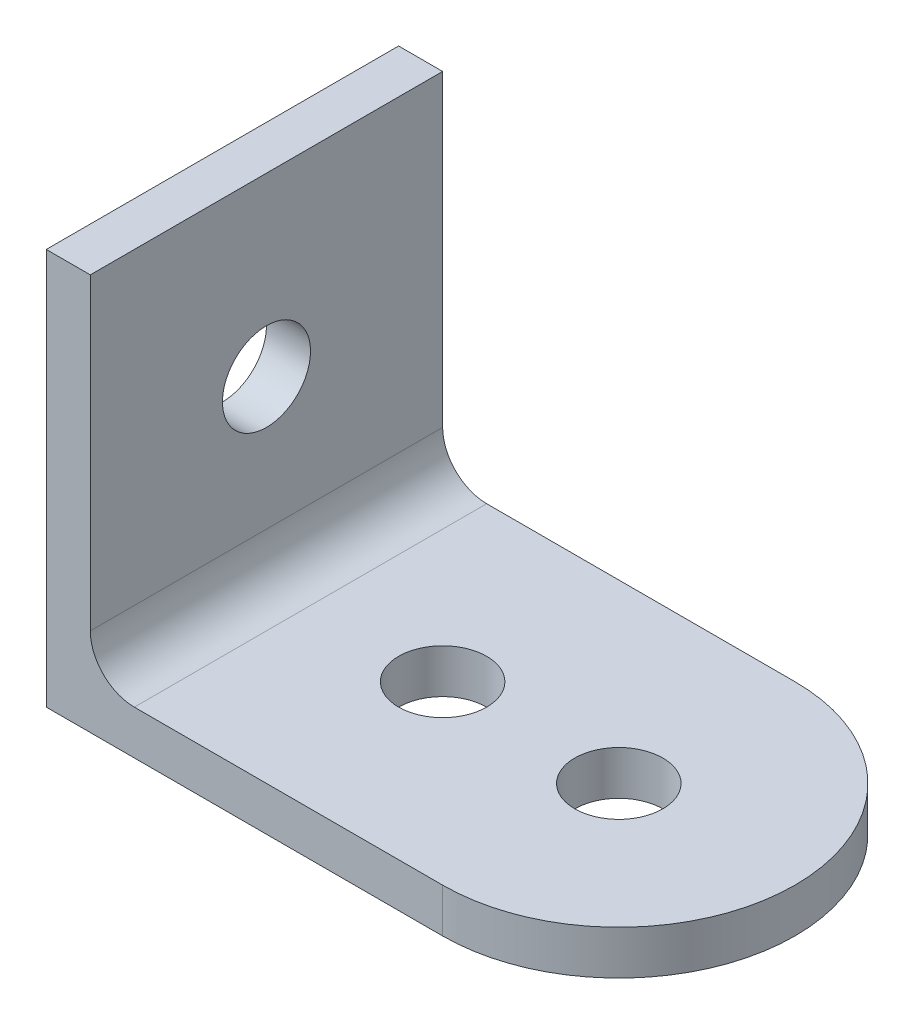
ISO-10303-21;
HEADER;
FILE_DESCRIPTION(('STEP AP214'),'2;1');
FILE_NAME('part.step','',(''),(''),'','','');
FILE_SCHEMA(('AUTOMOTIVE_DESIGN { 1 0 10303 214 1 1 1 1 }'));
ENDSEC;
DATA;
#1=APPLICATION_CONTEXT('core data for automotive mechanical design processes');
#2=APPLICATION_PROTOCOL_DEFINITION('international standard','automotive_design',2000,#1);
#3=PRODUCT_CONTEXT('',#1,'mechanical');
#4=PRODUCT('Part','Part','',(#3));
#5=PRODUCT_RELATED_PRODUCT_CATEGORY('part','',(#4));
#6=PRODUCT_DEFINITION_FORMATION('','',#4);
#7=PRODUCT_DEFINITION_CONTEXT('part definition',#1,'design');
#8=PRODUCT_DEFINITION('design','',#6,#7);
#9=PRODUCT_DEFINITION_SHAPE('','',#8);
#10=(LENGTH_UNIT() NAMED_UNIT(*) SI_UNIT(.MILLI.,.METRE.));
#11=(NAMED_UNIT(*) PLANE_ANGLE_UNIT() SI_UNIT($,.RADIAN.));
#12=(NAMED_UNIT(*) SI_UNIT($,.STERADIAN.) SOLID_ANGLE_UNIT());
#13=UNCERTAINTY_MEASURE_WITH_UNIT(LENGTH_MEASURE(1.E-05),#10,'distance_accuracy_value','');
#14=(GEOMETRIC_REPRESENTATION_CONTEXT(3) GLOBAL_UNCERTAINTY_ASSIGNED_CONTEXT((#13)) GLOBAL_UNIT_ASSIGNED_CONTEXT((#10,
#11,#12)) REPRESENTATION_CONTEXT('',''));
#15=CARTESIAN_POINT('',(0.,0.,0.));
#16=DIRECTION('',(0.,0.,1.));
#17=DIRECTION('',(1.,0.,0.));
#18=AXIS2_PLACEMENT_3D('',#15,#16,#17);
#19=CARTESIAN_POINT('',(50.8,-6.35,0.));
#20=DIRECTION('',(0.,-1.,0.));
#21=DIRECTION('',(0.,0.,-1.));
#22=AXIS2_PLACEMENT_3D('',#19,#20,#21);
#23=CYLINDRICAL_SURFACE('',#22,25.4);
#24=DIRECTION('',(0.,1.,0.));
#25=VECTOR('',#24,1.);
#26=CARTESIAN_POINT('',(50.8,-6.35,25.4));
#27=LINE('',#26,#25);
#28=CARTESIAN_POINT('',(50.8,-6.35,25.4));
#29=VERTEX_POINT('',#28);
#30=CARTESIAN_POINT('',(50.8,0.,25.4));
#31=VERTEX_POINT('',#30);
#32=EDGE_CURVE('E99',#29,#31,#27,.T.);
#33=ORIENTED_EDGE('',*,*,#32,.F.);
#34=CARTESIAN_POINT('',(50.8,-6.35,0.));
#35=DIRECTION('',(0.,1.,0.));
#36=DIRECTION('',(0.,0.,1.));
#37=AXIS2_PLACEMENT_3D('',#34,#35,#36);
#38=CIRCLE('',#37,25.4);
#39=CARTESIAN_POINT('',(50.8,-6.35,-25.4));
#40=VERTEX_POINT('',#39);
#41=EDGE_CURVE('E138',#40,#29,#38,.F.);
#42=ORIENTED_EDGE('',*,*,#41,.F.);
#43=DIRECTION('',(0.,-1.,0.));
#44=VECTOR('',#43,1.);
#45=CARTESIAN_POINT('',(50.8,-6.35,-25.4));
#46=LINE('',#45,#44);
#47=CARTESIAN_POINT('',(50.8,0.,-25.4));
#48=VERTEX_POINT('',#47);
#49=EDGE_CURVE('E135',#48,#40,#46,.T.);
#50=ORIENTED_EDGE('',*,*,#49,.F.);
#51=CARTESIAN_POINT('',(50.8,0.,0.));
#52=DIRECTION('',(0.,1.,0.));
#53=DIRECTION('',(0.,0.,1.));
#54=AXIS2_PLACEMENT_3D('',#51,#52,#53);
#55=CIRCLE('',#54,25.4);
#56=EDGE_CURVE('E140',#31,#48,#55,.T.);
#57=ORIENTED_EDGE('',*,*,#56,.F.);
#58=EDGE_LOOP('',(#33,#42,#50,#57));
#59=FACE_BOUND('',#58,.T.);
#60=ADVANCED_FACE('F31',(#59),#23,.T.);
#61=CARTESIAN_POINT('',(0.,-6.35,25.4));
#62=DIRECTION('',(0.,1.,0.));
#63=DIRECTION('',(0.,0.,1.));
#64=AXIS2_PLACEMENT_3D('',#61,#62,#63);
#65=PLANE('',#64);
#66=CARTESIAN_POINT('',(50.8,-6.35,0.));
#67=DIRECTION('',(0.,1.,0.));
#68=DIRECTION('',(0.,0.,1.));
#69=AXIS2_PLACEMENT_3D('',#66,#67,#68);
#70=CIRCLE('',#69,6.35);
#71=CARTESIAN_POINT('',(50.8,-6.35,6.35));
#72=VERTEX_POINT('',#71);
#73=EDGE_CURVE('E167',#72,#72,#70,.T.);
#74=ORIENTED_EDGE('',*,*,#73,.T.);
#75=EDGE_LOOP('',(#74));
#76=FACE_BOUND('',#75,.T.);
#77=CARTESIAN_POINT('',(25.4,-6.35,0.));
#78=DIRECTION('',(0.,1.,0.));
#79=DIRECTION('',(0.,0.,1.));
#80=AXIS2_PLACEMENT_3D('',#77,#78,#79);
#81=CIRCLE('',#80,6.35);
#82=CARTESIAN_POINT('',(25.4,-6.35,6.35));
#83=VERTEX_POINT('',#82);
#84=EDGE_CURVE('E161',#83,#83,#81,.T.);
#85=ORIENTED_EDGE('',*,*,#84,.T.);
#86=EDGE_LOOP('',(#85));
#87=FACE_BOUND('',#86,.T.);
#88=DIRECTION('',(1.,0.,0.));
#89=VECTOR('',#88,1.);
#90=CARTESIAN_POINT('',(0.,-6.35,-25.4));
#91=LINE('',#90,#89);
#92=CARTESIAN_POINT('',(-6.35,-6.35,-25.4));
#93=VERTEX_POINT('',#92);
#94=EDGE_CURVE('E118',#93,#40,#91,.T.);
#95=ORIENTED_EDGE('',*,*,#94,.T.);
#96=ORIENTED_EDGE('',*,*,#41,.T.);
#97=DIRECTION('',(1.,0.,0.));
#98=VECTOR('',#97,1.);
#99=CARTESIAN_POINT('',(0.,-6.35,25.4));
#100=LINE('',#99,#98);
#101=CARTESIAN_POINT('',(-6.35,-6.35,25.4));
#102=VERTEX_POINT('',#101);
#103=EDGE_CURVE('E129',#102,#29,#100,.T.);
#104=ORIENTED_EDGE('',*,*,#103,.F.);
#105=DIRECTION('',(0.,0.,-1.));
#106=VECTOR('',#105,1.);
#107=CARTESIAN_POINT('',(-6.35,-6.35,25.4));
#108=LINE('',#107,#106);
#109=EDGE_CURVE('E114',#102,#93,#108,.T.);
#110=ORIENTED_EDGE('',*,*,#109,.T.);
#111=EDGE_LOOP('',(#95,#96,#104,#110));
#112=FACE_BOUND('',#111,.T.);
#113=ADVANCED_FACE('F154',(#76,#87,#112),#65,.F.);
#114=CARTESIAN_POINT('',(0.,0.,25.4));
#115=DIRECTION('',(0.,1.,0.));
#116=DIRECTION('',(0.,0.,1.));
#117=AXIS2_PLACEMENT_3D('',#114,#115,#116);
#118=PLANE('',#117);
#119=CARTESIAN_POINT('',(50.8,0.,0.));
#120=DIRECTION('',(0.,1.,0.));
#121=DIRECTION('',(0.,0.,1.));
#122=AXIS2_PLACEMENT_3D('',#119,#120,#121);
#123=CIRCLE('',#122,6.35);
#124=CARTESIAN_POINT('',(50.8,0.,6.35));
#125=VERTEX_POINT('',#124);
#126=EDGE_CURVE('E170',#125,#125,#123,.T.);
#127=ORIENTED_EDGE('',*,*,#126,.F.);
#128=EDGE_LOOP('',(#127));
#129=FACE_BOUND('',#128,.T.);
#130=CARTESIAN_POINT('',(25.4,0.,0.));
#131=DIRECTION('',(0.,1.,0.));
#132=DIRECTION('',(0.,0.,1.));
#133=AXIS2_PLACEMENT_3D('',#130,#131,#132);
#134=CIRCLE('',#133,6.35);
#135=CARTESIAN_POINT('',(25.4,0.,6.35));
#136=VERTEX_POINT('',#135);
#137=EDGE_CURVE('E164',#136,#136,#134,.T.);
#138=ORIENTED_EDGE('',*,*,#137,.F.);
#139=EDGE_LOOP('',(#138));
#140=FACE_BOUND('',#139,.T.);
#141=DIRECTION('',(1.,0.,0.));
#142=VECTOR('',#141,1.);
#143=CARTESIAN_POINT('',(0.,0.,-25.4));
#144=LINE('',#143,#142);
#145=CARTESIAN_POINT('',(6.35,0.,-25.4));
#146=VERTEX_POINT('',#145);
#147=EDGE_CURVE('E121',#146,#48,#144,.T.);
#148=ORIENTED_EDGE('',*,*,#147,.F.);
#149=DIRECTION('',(0.,0.,-1.));
#150=VECTOR('',#149,1.);
#151=CARTESIAN_POINT('',(6.35,0.,25.4));
#152=LINE('',#151,#150);
#153=CARTESIAN_POINT('',(6.35,0.,25.4));
#154=VERTEX_POINT('',#153);
#155=EDGE_CURVE('E52',#146,#154,#152,.F.);
#156=ORIENTED_EDGE('',*,*,#155,.T.);
#157=DIRECTION('',(1.,0.,0.));
#158=VECTOR('',#157,1.);
#159=CARTESIAN_POINT('',(0.,0.,25.4));
#160=LINE('',#159,#158);
#161=EDGE_CURVE('E108',#154,#31,#160,.T.);
#162=ORIENTED_EDGE('',*,*,#161,.T.);
#163=ORIENTED_EDGE('',*,*,#56,.T.);
#164=EDGE_LOOP('',(#148,#156,#162,#163));
#165=FACE_BOUND('',#164,.T.);
#166=ADVANCED_FACE('F185',(#129,#140,#165),#118,.T.);
#167=CARTESIAN_POINT('',(0.,0.,25.4));
#168=DIRECTION('',(1.,0.,0.));
#169=DIRECTION('',(0.,0.,-1.));
#170=AXIS2_PLACEMENT_3D('',#167,#168,#169);
#171=PLANE('',#170);
#172=CARTESIAN_POINT('',(0.,25.4,0.));
#173=DIRECTION('',(1.,0.,0.));
#174=DIRECTION('',(0.,0.,-1.));
#175=AXIS2_PLACEMENT_3D('',#172,#173,#174);
#176=CIRCLE('',#175,6.35);
#177=CARTESIAN_POINT('',(0.,25.4,-6.35));
#178=VERTEX_POINT('',#177);
#179=EDGE_CURVE('E158',#178,#178,#176,.T.);
#180=ORIENTED_EDGE('',*,*,#179,.F.);
#181=EDGE_LOOP('',(#180));
#182=FACE_BOUND('',#181,.T.);
#183=DIRECTION('',(0.,-1.,0.));
#184=VECTOR('',#183,1.);
#185=CARTESIAN_POINT('',(0.,0.,25.4));
#186=LINE('',#185,#184);
#187=CARTESIAN_POINT('',(0.,50.8,25.4));
#188=VERTEX_POINT('',#187);
#189=CARTESIAN_POINT('',(0.,6.35,25.4));
#190=VERTEX_POINT('',#189);
#191=EDGE_CURVE('E92',#188,#190,#186,.T.);
#192=ORIENTED_EDGE('',*,*,#191,.T.);
#193=DIRECTION('',(0.,0.,-1.));
#194=VECTOR('',#193,1.);
#195=CARTESIAN_POINT('',(0.,6.35,-25.4));
#196=LINE('',#195,#194);
#197=CARTESIAN_POINT('',(0.,6.35,-25.4));
#198=VERTEX_POINT('',#197);
#199=EDGE_CURVE('E143',#190,#198,#196,.T.);
#200=ORIENTED_EDGE('',*,*,#199,.T.);
#201=DIRECTION('',(0.,-1.,0.));
#202=VECTOR('',#201,1.);
#203=CARTESIAN_POINT('',(0.,0.,-25.4));
#204=LINE('',#203,#202);
#205=CARTESIAN_POINT('',(0.,50.8,-25.4));
#206=VERTEX_POINT('',#205);
#207=EDGE_CURVE('E94',#206,#198,#204,.T.);
#208=ORIENTED_EDGE('',*,*,#207,.F.);
#209=DIRECTION('',(0.,0.,-1.));
#210=VECTOR('',#209,1.);
#211=CARTESIAN_POINT('',(0.,50.8,25.4));
#212=LINE('',#211,#210);
#213=EDGE_CURVE('E88',#188,#206,#212,.T.);
#214=ORIENTED_EDGE('',*,*,#213,.F.);
#215=EDGE_LOOP('',(#192,#200,#208,#214));
#216=FACE_BOUND('',#215,.T.);
#217=ADVANCED_FACE('F90',(#182,#216),#171,.T.);
#218=CARTESIAN_POINT('',(-6.35,50.8,25.4));
#219=DIRECTION('',(0.,1.,0.));
#220=DIRECTION('',(0.,0.,1.));
#221=AXIS2_PLACEMENT_3D('',#218,#219,#220);
#222=PLANE('',#221);
#223=DIRECTION('',(1.,0.,0.));
#224=VECTOR('',#223,1.);
#225=CARTESIAN_POINT('',(-6.35,50.8,-25.4));
#226=LINE('',#225,#224);
#227=CARTESIAN_POINT('',(-6.35,50.8,-25.4));
#228=VERTEX_POINT('',#227);
#229=EDGE_CURVE('E125',#228,#206,#226,.T.);
#230=ORIENTED_EDGE('',*,*,#229,.F.);
#231=DIRECTION('',(0.,0.,-1.));
#232=VECTOR('',#231,1.);
#233=CARTESIAN_POINT('',(-6.35,50.8,25.4));
#234=LINE('',#233,#232);
#235=CARTESIAN_POINT('',(-6.35,50.8,25.4));
#236=VERTEX_POINT('',#235);
#237=EDGE_CURVE('E100',#236,#228,#234,.T.);
#238=ORIENTED_EDGE('',*,*,#237,.F.);
#239=DIRECTION('',(1.,0.,0.));
#240=VECTOR('',#239,1.);
#241=CARTESIAN_POINT('',(-6.35,50.8,25.4));
#242=LINE('',#241,#240);
#243=EDGE_CURVE('E106',#236,#188,#242,.T.);
#244=ORIENTED_EDGE('',*,*,#243,.T.);
#245=ORIENTED_EDGE('',*,*,#213,.T.);
#246=EDGE_LOOP('',(#230,#238,#244,#245));
#247=FACE_BOUND('',#246,.T.);
#248=ADVANCED_FACE('F110',(#247),#222,.T.);
#249=CARTESIAN_POINT('',(-6.35,0.,25.4));
#250=DIRECTION('',(1.,0.,0.));
#251=DIRECTION('',(0.,0.,-1.));
#252=AXIS2_PLACEMENT_3D('',#249,#250,#251);
#253=PLANE('',#252);
#254=CARTESIAN_POINT('',(-6.35,25.4,0.));
#255=DIRECTION('',(1.,0.,0.));
#256=DIRECTION('',(0.,0.,-1.));
#257=AXIS2_PLACEMENT_3D('',#254,#255,#256);
#258=CIRCLE('',#257,6.35);
#259=CARTESIAN_POINT('',(-6.35,25.4,-6.35));
#260=VERTEX_POINT('',#259);
#261=EDGE_CURVE('E122',#260,#260,#258,.T.);
#262=ORIENTED_EDGE('',*,*,#261,.T.);
#263=EDGE_LOOP('',(#262));
#264=FACE_BOUND('',#263,.T.);
#265=DIRECTION('',(0.,1.,0.));
#266=VECTOR('',#265,1.);
#267=CARTESIAN_POINT('',(-6.35,0.,-25.4));
#268=LINE('',#267,#266);
#269=EDGE_CURVE('E127',#228,#93,#268,.F.);
#270=ORIENTED_EDGE('',*,*,#269,.T.);
#271=ORIENTED_EDGE('',*,*,#109,.F.);
#272=DIRECTION('',(0.,1.,0.));
#273=VECTOR('',#272,1.);
#274=CARTESIAN_POINT('',(-6.35,0.,25.4));
#275=LINE('',#274,#273);
#276=EDGE_CURVE('E112',#236,#102,#275,.F.);
#277=ORIENTED_EDGE('',*,*,#276,.F.);
#278=ORIENTED_EDGE('',*,*,#237,.T.);
#279=EDGE_LOOP('',(#270,#271,#277,#278));
#280=FACE_BOUND('',#279,.T.);
#281=ADVANCED_FACE('F151',(#264,#280),#253,.F.);
#282=CARTESIAN_POINT('',(76.2,-6.35,25.4));
#283=DIRECTION('',(0.,0.,-1.));
#284=DIRECTION('',(-1.,0.,0.));
#285=AXIS2_PLACEMENT_3D('',#282,#283,#284);
#286=PLANE('',#285);
#287=ORIENTED_EDGE('',*,*,#103,.T.);
#288=ORIENTED_EDGE('',*,*,#32,.T.);
#289=ORIENTED_EDGE('',*,*,#161,.F.);
#290=CARTESIAN_POINT('',(6.35,6.35,25.4));
#291=DIRECTION('',(0.,0.,-1.));
#292=DIRECTION('',(-1.,0.,0.));
#293=AXIS2_PLACEMENT_3D('',#290,#291,#292);
#294=CIRCLE('',#293,6.35);
#295=EDGE_CURVE('E11',#154,#190,#294,.T.);
#296=ORIENTED_EDGE('',*,*,#295,.T.);
#297=ORIENTED_EDGE('',*,*,#191,.F.);
#298=ORIENTED_EDGE('',*,*,#243,.F.);
#299=ORIENTED_EDGE('',*,*,#276,.T.);
#300=EDGE_LOOP('',(#287,#288,#289,#296,#297,#298,#299));
#301=FACE_BOUND('',#300,.T.);
#302=ADVANCED_FACE('F105',(#301),#286,.F.);
#303=CARTESIAN_POINT('',(76.2,-6.35,-25.4));
#304=DIRECTION('',(0.,0.,-1.));
#305=DIRECTION('',(-1.,0.,0.));
#306=AXIS2_PLACEMENT_3D('',#303,#304,#305);
#307=PLANE('',#306);
#308=ORIENTED_EDGE('',*,*,#207,.T.);
#309=CARTESIAN_POINT('',(6.35,6.35,-25.4));
#310=DIRECTION('',(0.,0.,-1.));
#311=DIRECTION('',(-1.,0.,0.));
#312=AXIS2_PLACEMENT_3D('',#309,#310,#311);
#313=CIRCLE('',#312,6.35);
#314=EDGE_CURVE('E39',#198,#146,#313,.F.);
#315=ORIENTED_EDGE('',*,*,#314,.T.);
#316=ORIENTED_EDGE('',*,*,#147,.T.);
#317=ORIENTED_EDGE('',*,*,#49,.T.);
#318=ORIENTED_EDGE('',*,*,#94,.F.);
#319=ORIENTED_EDGE('',*,*,#269,.F.);
#320=ORIENTED_EDGE('',*,*,#229,.T.);
#321=EDGE_LOOP('',(#308,#315,#316,#317,#318,#319,#320));
#322=FACE_BOUND('',#321,.T.);
#323=ADVANCED_FACE('F146',(#322),#307,.T.);
#324=CARTESIAN_POINT('',(-6.35,25.4,0.));
#325=DIRECTION('',(1.,0.,0.));
#326=DIRECTION('',(0.,0.,-1.));
#327=AXIS2_PLACEMENT_3D('',#324,#325,#326);
#328=CYLINDRICAL_SURFACE('',#327,6.35);
#329=ORIENTED_EDGE('',*,*,#261,.F.);
#330=EDGE_LOOP('',(#329));
#331=FACE_BOUND('',#330,.T.);
#332=ORIENTED_EDGE('',*,*,#179,.T.);
#333=EDGE_LOOP('',(#332));
#334=FACE_BOUND('',#333,.T.);
#335=ADVANCED_FACE('F212',(#331,#334),#328,.F.);
#336=CARTESIAN_POINT('',(25.4,-6.35,0.));
#337=DIRECTION('',(0.,1.,0.));
#338=DIRECTION('',(0.,0.,1.));
#339=AXIS2_PLACEMENT_3D('',#336,#337,#338);
#340=CYLINDRICAL_SURFACE('',#339,6.35);
#341=ORIENTED_EDGE('',*,*,#84,.F.);
#342=EDGE_LOOP('',(#341));
#343=FACE_BOUND('',#342,.T.);
#344=ORIENTED_EDGE('',*,*,#137,.T.);
#345=EDGE_LOOP('',(#344));
#346=FACE_BOUND('',#345,.T.);
#347=ADVANCED_FACE('F181',(#343,#346),#340,.F.);
#348=CARTESIAN_POINT('',(50.8,-6.35,0.));
#349=DIRECTION('',(0.,1.,0.));
#350=DIRECTION('',(0.,0.,1.));
#351=AXIS2_PLACEMENT_3D('',#348,#349,#350);
#352=CYLINDRICAL_SURFACE('',#351,6.35);
#353=ORIENTED_EDGE('',*,*,#73,.F.);
#354=EDGE_LOOP('',(#353));
#355=FACE_BOUND('',#354,.T.);
#356=ORIENTED_EDGE('',*,*,#126,.T.);
#357=EDGE_LOOP('',(#356));
#358=FACE_BOUND('',#357,.T.);
#359=ADVANCED_FACE('F178',(#355,#358),#352,.F.);
#360=CARTESIAN_POINT('',(6.35,6.35,25.4));
#361=DIRECTION('',(0.,0.,1.));
#362=DIRECTION('',(1.,0.,0.));
#363=AXIS2_PLACEMENT_3D('',#360,#361,#362);
#364=CYLINDRICAL_SURFACE('',#363,6.35);
#365=ORIENTED_EDGE('',*,*,#295,.F.);
#366=ORIENTED_EDGE('',*,*,#155,.F.);
#367=ORIENTED_EDGE('',*,*,#314,.F.);
#368=ORIENTED_EDGE('',*,*,#199,.F.);
#369=EDGE_LOOP('',(#365,#366,#367,#368));
#370=FACE_BOUND('',#369,.T.);
#371=ADVANCED_FACE('F33',(#370),#364,.F.);
#372=CLOSED_SHELL('',(#60,#113,#166,#217,#248,#281,#302,#323,#335,#347,#359,#371));
#373=MANIFOLD_SOLID_BREP('B2',#372);
#374=ADVANCED_BREP_SHAPE_REPRESENTATION('',(#18,#373),#14);
#375=SHAPE_DEFINITION_REPRESENTATION(#9,#374);
ENDSEC;
END-ISO-10303-21;
